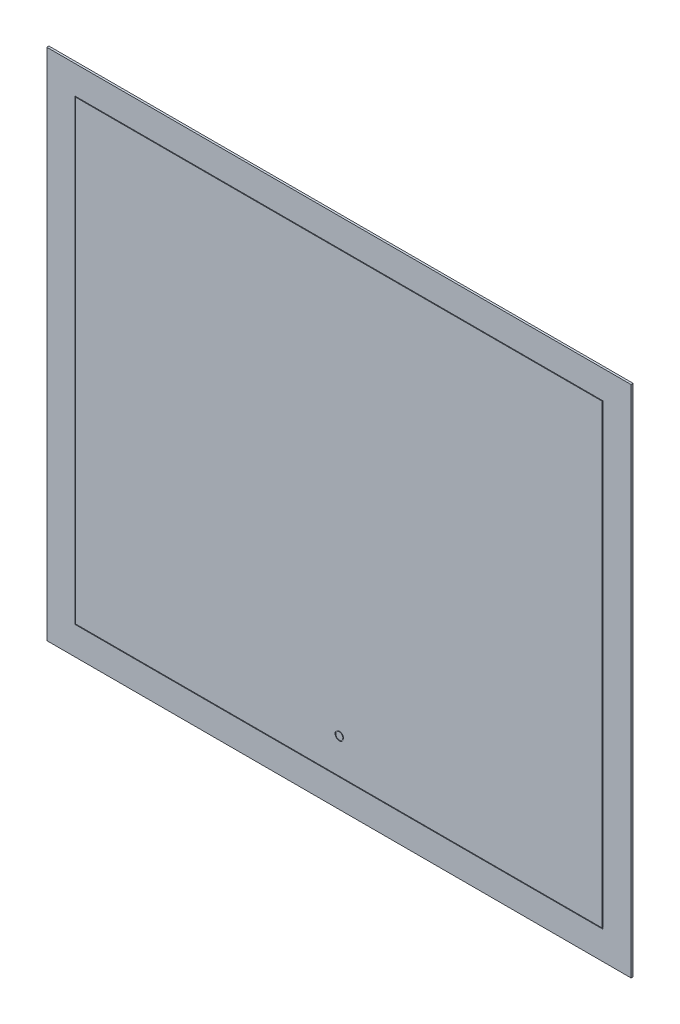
ISO-10303-21;
HEADER;
FILE_DESCRIPTION(('STEP AP214'),'2;1');
FILE_NAME('part.step','',(''),(''),'','','');
FILE_SCHEMA(('AUTOMOTIVE_DESIGN { 1 0 10303 214 1 1 1 1 }'));
ENDSEC;
DATA;
#1=APPLICATION_CONTEXT('core data for automotive mechanical design processes');
#2=APPLICATION_PROTOCOL_DEFINITION('international standard','automotive_design',2000,#1);
#3=PRODUCT_CONTEXT('',#1,'mechanical');
#4=PRODUCT('Part','Part','',(#3));
#5=PRODUCT_RELATED_PRODUCT_CATEGORY('part','',(#4));
#6=PRODUCT_DEFINITION_FORMATION('','',#4);
#7=PRODUCT_DEFINITION_CONTEXT('part definition',#1,'design');
#8=PRODUCT_DEFINITION('design','',#6,#7);
#9=PRODUCT_DEFINITION_SHAPE('','',#8);
#10=(LENGTH_UNIT() NAMED_UNIT(*) SI_UNIT(.MILLI.,.METRE.));
#11=(NAMED_UNIT(*) PLANE_ANGLE_UNIT() SI_UNIT($,.RADIAN.));
#12=(NAMED_UNIT(*) SI_UNIT($,.STERADIAN.) SOLID_ANGLE_UNIT());
#13=UNCERTAINTY_MEASURE_WITH_UNIT(LENGTH_MEASURE(1.E-05),#10,'distance_accuracy_value','');
#14=(GEOMETRIC_REPRESENTATION_CONTEXT(3) GLOBAL_UNCERTAINTY_ASSIGNED_CONTEXT((#13)) GLOBAL_UNIT_ASSIGNED_CONTEXT((#10,
#11,#12)) REPRESENTATION_CONTEXT('',''));
#15=CARTESIAN_POINT('',(0.,0.,0.));
#16=DIRECTION('',(0.,0.,1.));
#17=DIRECTION('',(1.,0.,0.));
#18=AXIS2_PLACEMENT_3D('',#15,#16,#17);
#19=CARTESIAN_POINT('',(0.,0.,0.));
#20=DIRECTION('',(0.,0.,1.));
#21=DIRECTION('',(1.,0.,0.));
#22=AXIS2_PLACEMENT_3D('',#19,#20,#21);
#23=PLANE('',#22);
#24=DIRECTION('',(-1.,0.,0.));
#25=VECTOR('',#24,1.);
#26=CARTESIAN_POINT('',(0.,0.,0.));
#27=LINE('',#26,#25);
#28=CARTESIAN_POINT('',(830.,0.,0.));
#29=VERTEX_POINT('',#28);
#30=CARTESIAN_POINT('',(0.,0.,0.));
#31=VERTEX_POINT('',#30);
#32=EDGE_CURVE('E356',#29,#31,#27,.T.);
#33=ORIENTED_EDGE('',*,*,#32,.T.);
#34=DIRECTION('',(0.,1.,0.));
#35=VECTOR('',#34,1.);
#36=CARTESIAN_POINT('',(0.,0.,0.));
#37=LINE('',#36,#35);
#38=CARTESIAN_POINT('',(0.,730.,0.));
#39=VERTEX_POINT('',#38);
#40=EDGE_CURVE('E371',#31,#39,#37,.T.);
#41=ORIENTED_EDGE('',*,*,#40,.T.);
#42=DIRECTION('',(1.,0.,0.));
#43=VECTOR('',#42,1.);
#44=CARTESIAN_POINT('',(0.,730.,0.));
#45=LINE('',#44,#43);
#46=CARTESIAN_POINT('',(830.,730.,0.));
#47=VERTEX_POINT('',#46);
#48=EDGE_CURVE('E391',#39,#47,#45,.T.);
#49=ORIENTED_EDGE('',*,*,#48,.T.);
#50=DIRECTION('',(0.,-1.,0.));
#51=VECTOR('',#50,1.);
#52=CARTESIAN_POINT('',(830.,1.26230837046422E-13,0.));
#53=LINE('',#52,#51);
#54=EDGE_CURVE('E387',#47,#29,#53,.T.);
#55=ORIENTED_EDGE('',*,*,#54,.T.);
#56=EDGE_LOOP('',(#33,#41,#49,#55));
#57=FACE_BOUND('',#56,.T.);
#58=DIRECTION('',(0.,-1.,0.));
#59=VECTOR('',#58,1.);
#60=CARTESIAN_POINT('',(795.,695.,0.));
#61=LINE('',#60,#59);
#62=CARTESIAN_POINT('',(795.,695.,0.));
#63=VERTEX_POINT('',#62);
#64=CARTESIAN_POINT('',(795.,35.,0.));
#65=VERTEX_POINT('',#64);
#66=EDGE_CURVE('E67',#63,#65,#61,.T.);
#67=ORIENTED_EDGE('',*,*,#66,.F.);
#68=DIRECTION('',(1.,0.,0.));
#69=VECTOR('',#68,1.);
#70=CARTESIAN_POINT('',(35.,695.,0.));
#71=LINE('',#70,#69);
#72=CARTESIAN_POINT('',(35.,695.,0.));
#73=VERTEX_POINT('',#72);
#74=EDGE_CURVE('E239',#73,#63,#71,.T.);
#75=ORIENTED_EDGE('',*,*,#74,.F.);
#76=DIRECTION('',(0.,1.,0.));
#77=VECTOR('',#76,1.);
#78=CARTESIAN_POINT('',(35.,35.,0.));
#79=LINE('',#78,#77);
#80=CARTESIAN_POINT('',(35.,35.,0.));
#81=VERTEX_POINT('',#80);
#82=EDGE_CURVE('E255',#81,#73,#79,.T.);
#83=ORIENTED_EDGE('',*,*,#82,.F.);
#84=DIRECTION('',(-1.,0.,0.));
#85=VECTOR('',#84,1.);
#86=CARTESIAN_POINT('',(795.,35.,0.));
#87=LINE('',#86,#85);
#88=EDGE_CURVE('E251',#65,#81,#87,.T.);
#89=ORIENTED_EDGE('',*,*,#88,.F.);
#90=EDGE_LOOP('',(#67,#75,#83,#89));
#91=FACE_BOUND('',#90,.T.);
#92=ADVANCED_FACE('F43',(#57,#91),#23,.F.);
#93=CARTESIAN_POINT('',(0.,0.,3.));
#94=DIRECTION('',(0.,-1.,0.));
#95=DIRECTION('',(1.,0.,0.));
#96=AXIS2_PLACEMENT_3D('',#93,#94,#95);
#97=PLANE('',#96);
#98=ORIENTED_EDGE('',*,*,#32,.F.);
#99=DIRECTION('',(0.,0.,-1.));
#100=VECTOR('',#99,1.);
#101=CARTESIAN_POINT('',(830.,0.,3.));
#102=LINE('',#101,#100);
#103=CARTESIAN_POINT('',(830.,0.,3.));
#104=VERTEX_POINT('',#103);
#105=EDGE_CURVE('E11',#104,#29,#102,.T.);
#106=ORIENTED_EDGE('',*,*,#105,.F.);
#107=DIRECTION('',(-1.,0.,0.));
#108=VECTOR('',#107,1.);
#109=CARTESIAN_POINT('',(0.,0.,3.));
#110=LINE('',#109,#108);
#111=CARTESIAN_POINT('',(0.,0.,3.));
#112=VERTEX_POINT('',#111);
#113=EDGE_CURVE('E366',#104,#112,#110,.T.);
#114=ORIENTED_EDGE('',*,*,#113,.T.);
#115=DIRECTION('',(0.,0.,-1.));
#116=VECTOR('',#115,1.);
#117=CARTESIAN_POINT('',(0.,0.,3.));
#118=LINE('',#117,#116);
#119=EDGE_CURVE('E383',#112,#31,#118,.T.);
#120=ORIENTED_EDGE('',*,*,#119,.T.);
#121=EDGE_LOOP('',(#98,#106,#114,#120));
#122=FACE_BOUND('',#121,.T.);
#123=ADVANCED_FACE('F45',(#122),#97,.T.);
#124=CARTESIAN_POINT('',(830.,1.26230837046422E-13,3.));
#125=DIRECTION('',(1.,0.,0.));
#126=DIRECTION('',(0.,1.,0.));
#127=AXIS2_PLACEMENT_3D('',#124,#125,#126);
#128=PLANE('',#127);
#129=ORIENTED_EDGE('',*,*,#54,.F.);
#130=DIRECTION('',(0.,0.,-1.));
#131=VECTOR('',#130,1.);
#132=CARTESIAN_POINT('',(830.,730.,3.));
#133=LINE('',#132,#131);
#134=CARTESIAN_POINT('',(830.,730.,3.));
#135=VERTEX_POINT('',#134);
#136=EDGE_CURVE('E52',#135,#47,#133,.T.);
#137=ORIENTED_EDGE('',*,*,#136,.F.);
#138=DIRECTION('',(0.,-1.,0.));
#139=VECTOR('',#138,1.);
#140=CARTESIAN_POINT('',(830.,1.26230837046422E-13,3.));
#141=LINE('',#140,#139);
#142=EDGE_CURVE('E370',#135,#104,#141,.T.);
#143=ORIENTED_EDGE('',*,*,#142,.T.);
#144=ORIENTED_EDGE('',*,*,#105,.T.);
#145=EDGE_LOOP('',(#129,#137,#143,#144));
#146=FACE_BOUND('',#145,.T.);
#147=ADVANCED_FACE('F410',(#146),#128,.T.);
#148=CARTESIAN_POINT('',(0.,730.,3.));
#149=DIRECTION('',(0.,1.,0.));
#150=DIRECTION('',(0.,0.,1.));
#151=AXIS2_PLACEMENT_3D('',#148,#149,#150);
#152=PLANE('',#151);
#153=ORIENTED_EDGE('',*,*,#48,.F.);
#154=DIRECTION('',(0.,0.,-1.));
#155=VECTOR('',#154,1.);
#156=CARTESIAN_POINT('',(0.,730.,3.));
#157=LINE('',#156,#155);
#158=CARTESIAN_POINT('',(0.,730.,3.));
#159=VERTEX_POINT('',#158);
#160=EDGE_CURVE('E400',#159,#39,#157,.T.);
#161=ORIENTED_EDGE('',*,*,#160,.F.);
#162=DIRECTION('',(1.,0.,0.));
#163=VECTOR('',#162,1.);
#164=CARTESIAN_POINT('',(0.,730.,3.));
#165=LINE('',#164,#163);
#166=EDGE_CURVE('E375',#159,#135,#165,.T.);
#167=ORIENTED_EDGE('',*,*,#166,.T.);
#168=ORIENTED_EDGE('',*,*,#136,.T.);
#169=EDGE_LOOP('',(#153,#161,#167,#168));
#170=FACE_BOUND('',#169,.T.);
#171=ADVANCED_FACE('F406',(#170),#152,.T.);
#172=CARTESIAN_POINT('',(0.,0.,3.));
#173=DIRECTION('',(-1.,0.,0.));
#174=DIRECTION('',(0.,0.,1.));
#175=AXIS2_PLACEMENT_3D('',#172,#173,#174);
#176=PLANE('',#175);
#177=ORIENTED_EDGE('',*,*,#40,.F.);
#178=ORIENTED_EDGE('',*,*,#119,.F.);
#179=DIRECTION('',(0.,1.,0.));
#180=VECTOR('',#179,1.);
#181=CARTESIAN_POINT('',(0.,0.,3.));
#182=LINE('',#181,#180);
#183=EDGE_CURVE('E379',#112,#159,#182,.T.);
#184=ORIENTED_EDGE('',*,*,#183,.T.);
#185=ORIENTED_EDGE('',*,*,#160,.T.);
#186=EDGE_LOOP('',(#177,#178,#184,#185));
#187=FACE_BOUND('',#186,.T.);
#188=ADVANCED_FACE('F415',(#187),#176,.T.);
#189=CARTESIAN_POINT('',(0.,0.,3.));
#190=DIRECTION('',(0.,0.,1.));
#191=DIRECTION('',(1.,0.,0.));
#192=AXIS2_PLACEMENT_3D('',#189,#190,#191);
#193=PLANE('',#192);
#194=DIRECTION('',(0.,-1.,0.));
#195=VECTOR('',#194,1.);
#196=CARTESIAN_POINT('',(40.,690.,3.));
#197=LINE('',#196,#195);
#198=CARTESIAN_POINT('',(40.,690.,3.));
#199=VERTEX_POINT('',#198);
#200=CARTESIAN_POINT('',(40.,40.,3.));
#201=VERTEX_POINT('',#200);
#202=EDGE_CURVE('E312',#199,#201,#197,.T.);
#203=ORIENTED_EDGE('',*,*,#202,.F.);
#204=DIRECTION('',(-1.,0.,0.));
#205=VECTOR('',#204,1.);
#206=CARTESIAN_POINT('',(790.,690.,3.));
#207=LINE('',#206,#205);
#208=CARTESIAN_POINT('',(790.,690.,3.));
#209=VERTEX_POINT('',#208);
#210=EDGE_CURVE('E327',#209,#199,#207,.T.);
#211=ORIENTED_EDGE('',*,*,#210,.F.);
#212=DIRECTION('',(0.,1.,0.));
#213=VECTOR('',#212,1.);
#214=CARTESIAN_POINT('',(790.,40.,3.));
#215=LINE('',#214,#213);
#216=CARTESIAN_POINT('',(790.,40.,3.));
#217=VERTEX_POINT('',#216);
#218=EDGE_CURVE('E346',#217,#209,#215,.T.);
#219=ORIENTED_EDGE('',*,*,#218,.F.);
#220=DIRECTION('',(1.,0.,0.));
#221=VECTOR('',#220,1.);
#222=CARTESIAN_POINT('',(40.,40.,3.));
#223=LINE('',#222,#221);
#224=EDGE_CURVE('E342',#201,#217,#223,.T.);
#225=ORIENTED_EDGE('',*,*,#224,.F.);
#226=EDGE_LOOP('',(#203,#211,#219,#225));
#227=FACE_BOUND('',#226,.T.);
#228=ORIENTED_EDGE('',*,*,#113,.F.);
#229=ORIENTED_EDGE('',*,*,#142,.F.);
#230=ORIENTED_EDGE('',*,*,#166,.F.);
#231=ORIENTED_EDGE('',*,*,#183,.F.);
#232=EDGE_LOOP('',(#228,#229,#230,#231));
#233=FACE_BOUND('',#232,.T.);
#234=ADVANCED_FACE('F419',(#227,#233),#193,.T.);
#235=CARTESIAN_POINT('',(40.,690.,2.));
#236=DIRECTION('',(-1.,0.,0.));
#237=DIRECTION('',(0.,0.,1.));
#238=AXIS2_PLACEMENT_3D('',#235,#236,#237);
#239=PLANE('',#238);
#240=ORIENTED_EDGE('',*,*,#202,.T.);
#241=DIRECTION('',(0.,0.,1.));
#242=VECTOR('',#241,1.);
#243=CARTESIAN_POINT('',(40.,40.,2.));
#244=LINE('',#243,#242);
#245=CARTESIAN_POINT('',(40.,40.,2.));
#246=VERTEX_POINT('',#245);
#247=EDGE_CURVE('E339',#246,#201,#244,.T.);
#248=ORIENTED_EDGE('',*,*,#247,.F.);
#249=DIRECTION('',(0.,-1.,0.));
#250=VECTOR('',#249,1.);
#251=CARTESIAN_POINT('',(40.,690.,2.));
#252=LINE('',#251,#250);
#253=CARTESIAN_POINT('',(40.,690.,2.));
#254=VERTEX_POINT('',#253);
#255=EDGE_CURVE('E322',#254,#246,#252,.T.);
#256=ORIENTED_EDGE('',*,*,#255,.F.);
#257=DIRECTION('',(0.,0.,1.));
#258=VECTOR('',#257,1.);
#259=CARTESIAN_POINT('',(40.,690.,2.));
#260=LINE('',#259,#258);
#261=EDGE_CURVE('E353',#254,#199,#260,.T.);
#262=ORIENTED_EDGE('',*,*,#261,.T.);
#263=EDGE_LOOP('',(#240,#248,#256,#262));
#264=FACE_BOUND('',#263,.T.);
#265=ADVANCED_FACE('F450',(#264),#239,.F.);
#266=CARTESIAN_POINT('',(790.,690.,2.));
#267=DIRECTION('',(0.,1.,0.));
#268=DIRECTION('',(0.,0.,1.));
#269=AXIS2_PLACEMENT_3D('',#266,#267,#268);
#270=PLANE('',#269);
#271=ORIENTED_EDGE('',*,*,#210,.T.);
#272=ORIENTED_EDGE('',*,*,#261,.F.);
#273=DIRECTION('',(-1.,0.,0.));
#274=VECTOR('',#273,1.);
#275=CARTESIAN_POINT('',(790.,690.,2.));
#276=LINE('',#275,#274);
#277=CARTESIAN_POINT('',(790.,690.,2.));
#278=VERTEX_POINT('',#277);
#279=EDGE_CURVE('E335',#278,#254,#276,.T.);
#280=ORIENTED_EDGE('',*,*,#279,.F.);
#281=DIRECTION('',(0.,0.,1.));
#282=VECTOR('',#281,1.);
#283=CARTESIAN_POINT('',(790.,690.,2.));
#284=LINE('',#283,#282);
#285=EDGE_CURVE('E357',#278,#209,#284,.T.);
#286=ORIENTED_EDGE('',*,*,#285,.T.);
#287=EDGE_LOOP('',(#271,#272,#280,#286));
#288=FACE_BOUND('',#287,.T.);
#289=ADVANCED_FACE('F459',(#288),#270,.F.);
#290=CARTESIAN_POINT('',(790.,40.,2.));
#291=DIRECTION('',(1.,0.,0.));
#292=DIRECTION('',(0.,1.,0.));
#293=AXIS2_PLACEMENT_3D('',#290,#291,#292);
#294=PLANE('',#293);
#295=ORIENTED_EDGE('',*,*,#218,.T.);
#296=ORIENTED_EDGE('',*,*,#285,.F.);
#297=DIRECTION('',(0.,1.,0.));
#298=VECTOR('',#297,1.);
#299=CARTESIAN_POINT('',(790.,40.,2.));
#300=LINE('',#299,#298);
#301=CARTESIAN_POINT('',(790.,40.,2.));
#302=VERTEX_POINT('',#301);
#303=EDGE_CURVE('E331',#302,#278,#300,.T.);
#304=ORIENTED_EDGE('',*,*,#303,.F.);
#305=DIRECTION('',(0.,0.,1.));
#306=VECTOR('',#305,1.);
#307=CARTESIAN_POINT('',(790.,40.,2.));
#308=LINE('',#307,#306);
#309=EDGE_CURVE('E360',#302,#217,#308,.T.);
#310=ORIENTED_EDGE('',*,*,#309,.T.);
#311=EDGE_LOOP('',(#295,#296,#304,#310));
#312=FACE_BOUND('',#311,.T.);
#313=ADVANCED_FACE('F466',(#312),#294,.F.);
#314=CARTESIAN_POINT('',(40.,40.,2.));
#315=DIRECTION('',(0.,-1.,0.));
#316=DIRECTION('',(1.,0.,0.));
#317=AXIS2_PLACEMENT_3D('',#314,#315,#316);
#318=PLANE('',#317);
#319=ORIENTED_EDGE('',*,*,#224,.T.);
#320=ORIENTED_EDGE('',*,*,#309,.F.);
#321=DIRECTION('',(1.,0.,0.));
#322=VECTOR('',#321,1.);
#323=CARTESIAN_POINT('',(40.,40.,2.));
#324=LINE('',#323,#322);
#325=EDGE_CURVE('E326',#246,#302,#324,.T.);
#326=ORIENTED_EDGE('',*,*,#325,.F.);
#327=ORIENTED_EDGE('',*,*,#247,.T.);
#328=EDGE_LOOP('',(#319,#320,#326,#327));
#329=FACE_BOUND('',#328,.T.);
#330=ADVANCED_FACE('F474',(#329),#318,.F.);
#331=CARTESIAN_POINT('',(0.,0.,2.));
#332=DIRECTION('',(0.,0.,1.));
#333=DIRECTION('',(1.,0.,0.));
#334=AXIS2_PLACEMENT_3D('',#331,#332,#333);
#335=PLANE('',#334);
#336=DIRECTION('',(0.,1.,0.));
#337=VECTOR('',#336,1.);
#338=CARTESIAN_POINT('',(789.,41.,2.));
#339=LINE('',#338,#337);
#340=CARTESIAN_POINT('',(789.,41.,2.));
#341=VERTEX_POINT('',#340);
#342=CARTESIAN_POINT('',(789.,689.,2.));
#343=VERTEX_POINT('',#342);
#344=EDGE_CURVE('E290',#341,#343,#339,.T.);
#345=ORIENTED_EDGE('',*,*,#344,.F.);
#346=DIRECTION('',(1.,0.,0.));
#347=VECTOR('',#346,1.);
#348=CARTESIAN_POINT('',(41.,41.,2.));
#349=LINE('',#348,#347);
#350=CARTESIAN_POINT('',(41.,41.,2.));
#351=VERTEX_POINT('',#350);
#352=EDGE_CURVE('E286',#351,#341,#349,.T.);
#353=ORIENTED_EDGE('',*,*,#352,.F.);
#354=DIRECTION('',(0.,-1.,0.));
#355=VECTOR('',#354,1.);
#356=CARTESIAN_POINT('',(41.,689.,2.));
#357=LINE('',#356,#355);
#358=CARTESIAN_POINT('',(41.,689.,2.));
#359=VERTEX_POINT('',#358);
#360=EDGE_CURVE('E281',#359,#351,#357,.T.);
#361=ORIENTED_EDGE('',*,*,#360,.F.);
#362=DIRECTION('',(-1.,0.,0.));
#363=VECTOR('',#362,1.);
#364=CARTESIAN_POINT('',(789.,689.,2.));
#365=LINE('',#364,#363);
#366=EDGE_CURVE('E277',#343,#359,#365,.T.);
#367=ORIENTED_EDGE('',*,*,#366,.F.);
#368=EDGE_LOOP('',(#345,#353,#361,#367));
#369=FACE_BOUND('',#368,.T.);
#370=ORIENTED_EDGE('',*,*,#255,.T.);
#371=ORIENTED_EDGE('',*,*,#325,.T.);
#372=ORIENTED_EDGE('',*,*,#303,.T.);
#373=ORIENTED_EDGE('',*,*,#279,.T.);
#374=EDGE_LOOP('',(#370,#371,#372,#373));
#375=FACE_BOUND('',#374,.T.);
#376=ADVANCED_FACE('F482',(#369,#375),#335,.T.);
#377=CARTESIAN_POINT('',(789.,689.,2.));
#378=DIRECTION('',(0.,1.,0.));
#379=DIRECTION('',(0.,0.,1.));
#380=AXIS2_PLACEMENT_3D('',#377,#378,#379);
#381=PLANE('',#380);
#382=DIRECTION('',(-1.,0.,0.));
#383=VECTOR('',#382,1.);
#384=CARTESIAN_POINT('',(789.,689.,3.));
#385=LINE('',#384,#383);
#386=CARTESIAN_POINT('',(789.,689.,3.));
#387=VERTEX_POINT('',#386);
#388=CARTESIAN_POINT('',(41.,689.,3.));
#389=VERTEX_POINT('',#388);
#390=EDGE_CURVE('E276',#387,#389,#385,.T.);
#391=ORIENTED_EDGE('',*,*,#390,.F.);
#392=DIRECTION('',(0.,0.,1.));
#393=VECTOR('',#392,1.);
#394=CARTESIAN_POINT('',(789.,689.,2.));
#395=LINE('',#394,#393);
#396=EDGE_CURVE('E309',#343,#387,#395,.T.);
#397=ORIENTED_EDGE('',*,*,#396,.F.);
#398=ORIENTED_EDGE('',*,*,#366,.T.);
#399=DIRECTION('',(0.,0.,1.));
#400=VECTOR('',#399,1.);
#401=CARTESIAN_POINT('',(41.,689.,2.));
#402=LINE('',#401,#400);
#403=EDGE_CURVE('E294',#359,#389,#402,.T.);
#404=ORIENTED_EDGE('',*,*,#403,.T.);
#405=EDGE_LOOP('',(#391,#397,#398,#404));
#406=FACE_BOUND('',#405,.T.);
#407=ADVANCED_FACE('F490',(#406),#381,.T.);
#408=CARTESIAN_POINT('',(789.,41.,2.));
#409=DIRECTION('',(1.,0.,0.));
#410=DIRECTION('',(0.,0.,-1.));
#411=AXIS2_PLACEMENT_3D('',#408,#409,#410);
#412=PLANE('',#411);
#413=DIRECTION('',(0.,1.,0.));
#414=VECTOR('',#413,1.);
#415=CARTESIAN_POINT('',(789.,41.,3.));
#416=LINE('',#415,#414);
#417=CARTESIAN_POINT('',(789.,41.,3.));
#418=VERTEX_POINT('',#417);
#419=EDGE_CURVE('E282',#418,#387,#416,.T.);
#420=ORIENTED_EDGE('',*,*,#419,.F.);
#421=DIRECTION('',(0.,0.,1.));
#422=VECTOR('',#421,1.);
#423=CARTESIAN_POINT('',(789.,41.,2.));
#424=LINE('',#423,#422);
#425=EDGE_CURVE('E313',#341,#418,#424,.T.);
#426=ORIENTED_EDGE('',*,*,#425,.F.);
#427=ORIENTED_EDGE('',*,*,#344,.T.);
#428=ORIENTED_EDGE('',*,*,#396,.T.);
#429=EDGE_LOOP('',(#420,#426,#427,#428));
#430=FACE_BOUND('',#429,.T.);
#431=ADVANCED_FACE('F498',(#430),#412,.T.);
#432=CARTESIAN_POINT('',(41.,41.,2.));
#433=DIRECTION('',(0.,-1.,0.));
#434=DIRECTION('',(1.,0.,0.));
#435=AXIS2_PLACEMENT_3D('',#432,#433,#434);
#436=PLANE('',#435);
#437=DIRECTION('',(1.,0.,0.));
#438=VECTOR('',#437,1.);
#439=CARTESIAN_POINT('',(41.,41.,3.));
#440=LINE('',#439,#438);
#441=CARTESIAN_POINT('',(41.,41.,3.));
#442=VERTEX_POINT('',#441);
#443=EDGE_CURVE('E302',#442,#418,#440,.T.);
#444=ORIENTED_EDGE('',*,*,#443,.F.);
#445=DIRECTION('',(0.,0.,1.));
#446=VECTOR('',#445,1.);
#447=CARTESIAN_POINT('',(41.,41.,2.));
#448=LINE('',#447,#446);
#449=EDGE_CURVE('E316',#351,#442,#448,.T.);
#450=ORIENTED_EDGE('',*,*,#449,.F.);
#451=ORIENTED_EDGE('',*,*,#352,.T.);
#452=ORIENTED_EDGE('',*,*,#425,.T.);
#453=EDGE_LOOP('',(#444,#450,#451,#452));
#454=FACE_BOUND('',#453,.T.);
#455=ADVANCED_FACE('F506',(#454),#436,.T.);
#456=CARTESIAN_POINT('',(41.,689.,2.));
#457=DIRECTION('',(-1.,0.,0.));
#458=DIRECTION('',(0.,0.,1.));
#459=AXIS2_PLACEMENT_3D('',#456,#457,#458);
#460=PLANE('',#459);
#461=DIRECTION('',(0.,-1.,0.));
#462=VECTOR('',#461,1.);
#463=CARTESIAN_POINT('',(41.,689.,3.));
#464=LINE('',#463,#462);
#465=EDGE_CURVE('E298',#389,#442,#464,.T.);
#466=ORIENTED_EDGE('',*,*,#465,.F.);
#467=ORIENTED_EDGE('',*,*,#403,.F.);
#468=ORIENTED_EDGE('',*,*,#360,.T.);
#469=ORIENTED_EDGE('',*,*,#449,.T.);
#470=EDGE_LOOP('',(#466,#467,#468,#469));
#471=FACE_BOUND('',#470,.T.);
#472=ADVANCED_FACE('F514',(#471),#460,.T.);
#473=CARTESIAN_POINT('',(415.5,90.4999999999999,3.));
#474=DIRECTION('',(0.,0.,1.));
#475=DIRECTION('',(1.,0.,0.));
#476=AXIS2_PLACEMENT_3D('',#473,#474,#475);
#477=CIRCLE('',#476,5.99999999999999);
#478=CARTESIAN_POINT('',(421.5,90.4999999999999,3.));
#479=VERTEX_POINT('',#478);
#480=EDGE_CURVE('E210',#479,#479,#477,.T.);
#481=ORIENTED_EDGE('',*,*,#480,.F.);
#482=EDGE_LOOP('',(#481));
#483=FACE_BOUND('',#482,.T.);
#484=ORIENTED_EDGE('',*,*,#419,.T.);
#485=ORIENTED_EDGE('',*,*,#390,.T.);
#486=ORIENTED_EDGE('',*,*,#465,.T.);
#487=ORIENTED_EDGE('',*,*,#443,.T.);
#488=EDGE_LOOP('',(#484,#485,#486,#487));
#489=FACE_BOUND('',#488,.T.);
#490=ADVANCED_FACE('F453',(#483,#489),#193,.T.);
#491=CARTESIAN_POINT('',(795.,695.,-30.));
#492=DIRECTION('',(-1.,0.,0.));
#493=DIRECTION('',(0.,-1.,0.));
#494=AXIS2_PLACEMENT_3D('',#491,#492,#493);
#495=PLANE('',#494);
#496=ORIENTED_EDGE('',*,*,#66,.T.);
#497=DIRECTION('',(0.,0.,1.));
#498=VECTOR('',#497,1.);
#499=CARTESIAN_POINT('',(795.,35.,-30.));
#500=LINE('',#499,#498);
#501=CARTESIAN_POINT('',(795.,35.,-30.));
#502=VERTEX_POINT('',#501);
#503=EDGE_CURVE('E272',#502,#65,#500,.T.);
#504=ORIENTED_EDGE('',*,*,#503,.F.);
#505=DIRECTION('',(0.,-1.,0.));
#506=VECTOR('',#505,1.);
#507=CARTESIAN_POINT('',(795.,695.,-30.));
#508=LINE('',#507,#506);
#509=CARTESIAN_POINT('',(795.,695.,-30.));
#510=VERTEX_POINT('',#509);
#511=EDGE_CURVE('E234',#510,#502,#508,.T.);
#512=ORIENTED_EDGE('',*,*,#511,.F.);
#513=DIRECTION('',(0.,0.,1.));
#514=VECTOR('',#513,1.);
#515=CARTESIAN_POINT('',(795.,695.,-30.));
#516=LINE('',#515,#514);
#517=EDGE_CURVE('E248',#510,#63,#516,.T.);
#518=ORIENTED_EDGE('',*,*,#517,.T.);
#519=EDGE_LOOP('',(#496,#504,#512,#518));
#520=FACE_BOUND('',#519,.T.);
#521=ADVANCED_FACE('F529',(#520),#495,.F.);
#522=CARTESIAN_POINT('',(795.,35.,-30.));
#523=DIRECTION('',(0.,1.,0.));
#524=DIRECTION('',(-1.,0.,0.));
#525=AXIS2_PLACEMENT_3D('',#522,#523,#524);
#526=PLANE('',#525);
#527=ORIENTED_EDGE('',*,*,#88,.T.);
#528=DIRECTION('',(0.,0.,1.));
#529=VECTOR('',#528,1.);
#530=CARTESIAN_POINT('',(35.,35.,-30.));
#531=LINE('',#530,#529);
#532=CARTESIAN_POINT('',(35.,35.,-30.));
#533=VERTEX_POINT('',#532);
#534=EDGE_CURVE('E268',#533,#81,#531,.T.);
#535=ORIENTED_EDGE('',*,*,#534,.F.);
#536=DIRECTION('',(-1.,0.,0.));
#537=VECTOR('',#536,1.);
#538=CARTESIAN_POINT('',(795.,35.,-30.));
#539=LINE('',#538,#537);
#540=EDGE_CURVE('E238',#502,#533,#539,.T.);
#541=ORIENTED_EDGE('',*,*,#540,.F.);
#542=ORIENTED_EDGE('',*,*,#503,.T.);
#543=EDGE_LOOP('',(#527,#535,#541,#542));
#544=FACE_BOUND('',#543,.T.);
#545=ADVANCED_FACE('F536',(#544),#526,.F.);
#546=CARTESIAN_POINT('',(35.,35.,-30.));
#547=DIRECTION('',(1.,0.,0.));
#548=DIRECTION('',(0.,0.,-1.));
#549=AXIS2_PLACEMENT_3D('',#546,#547,#548);
#550=PLANE('',#549);
#551=ORIENTED_EDGE('',*,*,#82,.T.);
#552=DIRECTION('',(0.,0.,1.));
#553=VECTOR('',#552,1.);
#554=CARTESIAN_POINT('',(35.,695.,-30.));
#555=LINE('',#554,#553);
#556=CARTESIAN_POINT('',(35.,695.,-30.));
#557=VERTEX_POINT('',#556);
#558=EDGE_CURVE('E264',#557,#73,#555,.T.);
#559=ORIENTED_EDGE('',*,*,#558,.F.);
#560=DIRECTION('',(0.,1.,0.));
#561=VECTOR('',#560,1.);
#562=CARTESIAN_POINT('',(35.,35.,-30.));
#563=LINE('',#562,#561);
#564=EDGE_CURVE('E242',#533,#557,#563,.T.);
#565=ORIENTED_EDGE('',*,*,#564,.F.);
#566=ORIENTED_EDGE('',*,*,#534,.T.);
#567=EDGE_LOOP('',(#551,#559,#565,#566));
#568=FACE_BOUND('',#567,.T.);
#569=ADVANCED_FACE('F544',(#568),#550,.F.);
#570=CARTESIAN_POINT('',(35.,695.,-30.));
#571=DIRECTION('',(0.,-1.,0.));
#572=DIRECTION('',(0.,0.,-1.));
#573=AXIS2_PLACEMENT_3D('',#570,#571,#572);
#574=PLANE('',#573);
#575=ORIENTED_EDGE('',*,*,#74,.T.);
#576=ORIENTED_EDGE('',*,*,#517,.F.);
#577=DIRECTION('',(1.,0.,0.));
#578=VECTOR('',#577,1.);
#579=CARTESIAN_POINT('',(35.,695.,-30.));
#580=LINE('',#579,#578);
#581=EDGE_CURVE('E245',#557,#510,#580,.T.);
#582=ORIENTED_EDGE('',*,*,#581,.F.);
#583=ORIENTED_EDGE('',*,*,#558,.T.);
#584=EDGE_LOOP('',(#575,#576,#582,#583));
#585=FACE_BOUND('',#584,.T.);
#586=ADVANCED_FACE('F552',(#585),#574,.F.);
#587=CARTESIAN_POINT('',(0.,0.,-30.));
#588=DIRECTION('',(0.,0.,-1.));
#589=DIRECTION('',(-1.,0.,0.));
#590=AXIS2_PLACEMENT_3D('',#587,#588,#589);
#591=PLANE('',#590);
#592=DIRECTION('',(1.,0.,0.));
#593=VECTOR('',#592,1.);
#594=CARTESIAN_POINT('',(36.,694.,-30.));
#595=LINE('',#594,#593);
#596=CARTESIAN_POINT('',(36.,694.,-30.));
#597=VERTEX_POINT('',#596);
#598=CARTESIAN_POINT('',(794.,694.,-30.));
#599=VERTEX_POINT('',#598);
#600=EDGE_CURVE('E59',#597,#599,#595,.T.);
#601=ORIENTED_EDGE('',*,*,#600,.F.);
#602=DIRECTION('',(0.,1.,0.));
#603=VECTOR('',#602,1.);
#604=CARTESIAN_POINT('',(36.,36.,-30.));
#605=LINE('',#604,#603);
#606=CARTESIAN_POINT('',(36.,36.,-30.));
#607=VERTEX_POINT('',#606);
#608=EDGE_CURVE('E203',#607,#597,#605,.T.);
#609=ORIENTED_EDGE('',*,*,#608,.F.);
#610=DIRECTION('',(-1.,0.,0.));
#611=VECTOR('',#610,1.);
#612=CARTESIAN_POINT('',(794.,36.,-30.));
#613=LINE('',#612,#611);
#614=CARTESIAN_POINT('',(794.,36.,-30.));
#615=VERTEX_POINT('',#614);
#616=EDGE_CURVE('E207',#615,#607,#613,.T.);
#617=ORIENTED_EDGE('',*,*,#616,.F.);
#618=DIRECTION('',(0.,-1.,0.));
#619=VECTOR('',#618,1.);
#620=CARTESIAN_POINT('',(794.,694.,-30.));
#621=LINE('',#620,#619);
#622=EDGE_CURVE('E219',#599,#615,#621,.T.);
#623=ORIENTED_EDGE('',*,*,#622,.F.);
#624=EDGE_LOOP('',(#601,#609,#617,#623));
#625=FACE_BOUND('',#624,.T.);
#626=ORIENTED_EDGE('',*,*,#511,.T.);
#627=ORIENTED_EDGE('',*,*,#540,.T.);
#628=ORIENTED_EDGE('',*,*,#564,.T.);
#629=ORIENTED_EDGE('',*,*,#581,.T.);
#630=EDGE_LOOP('',(#626,#627,#628,#629));
#631=FACE_BOUND('',#630,.T.);
#632=ADVANCED_FACE('F560',(#625,#631),#591,.T.);
#633=CARTESIAN_POINT('',(36.,694.,0.));
#634=DIRECTION('',(0.,1.,0.));
#635=DIRECTION('',(0.,0.,1.));
#636=AXIS2_PLACEMENT_3D('',#633,#634,#635);
#637=PLANE('',#636);
#638=ORIENTED_EDGE('',*,*,#600,.T.);
#639=DIRECTION('',(0.,0.,-1.));
#640=VECTOR('',#639,1.);
#641=CARTESIAN_POINT('',(794.,694.,0.));
#642=LINE('',#641,#640);
#643=CARTESIAN_POINT('',(794.,694.,0.));
#644=VERTEX_POINT('',#643);
#645=EDGE_CURVE('E178',#644,#599,#642,.T.);
#646=ORIENTED_EDGE('',*,*,#645,.F.);
#647=DIRECTION('',(1.,0.,0.));
#648=VECTOR('',#647,1.);
#649=CARTESIAN_POINT('',(36.,694.,0.));
#650=LINE('',#649,#648);
#651=CARTESIAN_POINT('',(36.,694.,0.));
#652=VERTEX_POINT('',#651);
#653=EDGE_CURVE('E182',#652,#644,#650,.T.);
#654=ORIENTED_EDGE('',*,*,#653,.F.);
#655=DIRECTION('',(0.,0.,-1.));
#656=VECTOR('',#655,1.);
#657=CARTESIAN_POINT('',(36.,694.,0.));
#658=LINE('',#657,#656);
#659=EDGE_CURVE('E226',#652,#597,#658,.T.);
#660=ORIENTED_EDGE('',*,*,#659,.T.);
#661=EDGE_LOOP('',(#638,#646,#654,#660));
#662=FACE_BOUND('',#661,.T.);
#663=ADVANCED_FACE('F180',(#662),#637,.F.);
#664=CARTESIAN_POINT('',(36.,36.,0.));
#665=DIRECTION('',(-1.,0.,0.));
#666=DIRECTION('',(0.,0.,1.));
#667=AXIS2_PLACEMENT_3D('',#664,#665,#666);
#668=PLANE('',#667);
#669=ORIENTED_EDGE('',*,*,#608,.T.);
#670=ORIENTED_EDGE('',*,*,#659,.F.);
#671=DIRECTION('',(0.,1.,0.));
#672=VECTOR('',#671,1.);
#673=CARTESIAN_POINT('',(36.,36.,0.));
#674=LINE('',#673,#672);
#675=CARTESIAN_POINT('',(36.,36.,0.));
#676=VERTEX_POINT('',#675);
#677=EDGE_CURVE('E189',#676,#652,#674,.T.);
#678=ORIENTED_EDGE('',*,*,#677,.F.);
#679=DIRECTION('',(0.,0.,-1.));
#680=VECTOR('',#679,1.);
#681=CARTESIAN_POINT('',(36.,36.,0.));
#682=LINE('',#681,#680);
#683=EDGE_CURVE('E229',#676,#607,#682,.T.);
#684=ORIENTED_EDGE('',*,*,#683,.T.);
#685=EDGE_LOOP('',(#669,#670,#678,#684));
#686=FACE_BOUND('',#685,.T.);
#687=ADVANCED_FACE('F575',(#686),#668,.F.);
#688=CARTESIAN_POINT('',(794.,36.,0.));
#689=DIRECTION('',(0.,-1.,0.));
#690=DIRECTION('',(1.,0.,0.));
#691=AXIS2_PLACEMENT_3D('',#688,#689,#690);
#692=PLANE('',#691);
#693=ORIENTED_EDGE('',*,*,#616,.T.);
#694=ORIENTED_EDGE('',*,*,#683,.F.);
#695=DIRECTION('',(-1.,0.,0.));
#696=VECTOR('',#695,1.);
#697=CARTESIAN_POINT('',(794.,36.,0.));
#698=LINE('',#697,#696);
#699=CARTESIAN_POINT('',(794.,36.,0.));
#700=VERTEX_POINT('',#699);
#701=EDGE_CURVE('E198',#700,#676,#698,.T.);
#702=ORIENTED_EDGE('',*,*,#701,.F.);
#703=DIRECTION('',(0.,0.,-1.));
#704=VECTOR('',#703,1.);
#705=CARTESIAN_POINT('',(794.,36.,0.));
#706=LINE('',#705,#704);
#707=EDGE_CURVE('E188',#700,#615,#706,.T.);
#708=ORIENTED_EDGE('',*,*,#707,.T.);
#709=EDGE_LOOP('',(#693,#694,#702,#708));
#710=FACE_BOUND('',#709,.T.);
#711=ADVANCED_FACE('F582',(#710),#692,.F.);
#712=CARTESIAN_POINT('',(794.,694.,0.));
#713=DIRECTION('',(1.,0.,0.));
#714=DIRECTION('',(0.,1.,0.));
#715=AXIS2_PLACEMENT_3D('',#712,#713,#714);
#716=PLANE('',#715);
#717=ORIENTED_EDGE('',*,*,#622,.T.);
#718=ORIENTED_EDGE('',*,*,#707,.F.);
#719=DIRECTION('',(0.,-1.,0.));
#720=VECTOR('',#719,1.);
#721=CARTESIAN_POINT('',(794.,694.,0.));
#722=LINE('',#721,#720);
#723=EDGE_CURVE('E192',#644,#700,#722,.T.);
#724=ORIENTED_EDGE('',*,*,#723,.F.);
#725=ORIENTED_EDGE('',*,*,#645,.T.);
#726=EDGE_LOOP('',(#717,#718,#724,#725));
#727=FACE_BOUND('',#726,.T.);
#728=ADVANCED_FACE('F193',(#727),#716,.F.);
#729=CARTESIAN_POINT('',(0.,0.,0.));
#730=DIRECTION('',(0.,0.,-1.));
#731=DIRECTION('',(-1.,0.,0.));
#732=AXIS2_PLACEMENT_3D('',#729,#730,#731);
#733=PLANE('',#732);
#734=ORIENTED_EDGE('',*,*,#653,.T.);
#735=ORIENTED_EDGE('',*,*,#723,.T.);
#736=ORIENTED_EDGE('',*,*,#701,.T.);
#737=ORIENTED_EDGE('',*,*,#677,.T.);
#738=EDGE_LOOP('',(#734,#735,#736,#737));
#739=FACE_BOUND('',#738,.T.);
#740=ADVANCED_FACE('F200',(#739),#733,.T.);
#741=CARTESIAN_POINT('',(415.5,90.4999999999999,2.));
#742=DIRECTION('',(0.,0.,1.));
#743=DIRECTION('',(1.,0.,0.));
#744=AXIS2_PLACEMENT_3D('',#741,#742,#743);
#745=CYLINDRICAL_SURFACE('',#744,5.99999999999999);
#746=CARTESIAN_POINT('',(415.5,90.4999999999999,2.));
#747=DIRECTION('',(0.,0.,1.));
#748=DIRECTION('',(1.,0.,0.));
#749=AXIS2_PLACEMENT_3D('',#746,#747,#748);
#750=CIRCLE('',#749,5.99999999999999);
#751=CARTESIAN_POINT('',(421.5,90.4999999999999,2.));
#752=VERTEX_POINT('',#751);
#753=EDGE_CURVE('E220',#752,#752,#750,.T.);
#754=ORIENTED_EDGE('',*,*,#753,.F.);
#755=EDGE_LOOP('',(#754));
#756=FACE_BOUND('',#755,.T.);
#757=ORIENTED_EDGE('',*,*,#480,.T.);
#758=EDGE_LOOP('',(#757));
#759=FACE_BOUND('',#758,.T.);
#760=ADVANCED_FACE('F603',(#756,#759),#745,.F.);
#761=CARTESIAN_POINT('',(415.5,90.4999999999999,2.));
#762=DIRECTION('',(0.,0.,1.));
#763=DIRECTION('',(1.,0.,0.));
#764=AXIS2_PLACEMENT_3D('',#761,#762,#763);
#765=PLANE('',#764);
#766=CARTESIAN_POINT('',(415.5,90.4999999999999,2.));
#767=DIRECTION('',(0.,0.,1.));
#768=DIRECTION('',(1.,0.,0.));
#769=AXIS2_PLACEMENT_3D('',#766,#767,#768);
#770=CIRCLE('',#769,4.99999999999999);
#771=CARTESIAN_POINT('',(420.5,90.4999999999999,2.));
#772=VERTEX_POINT('',#771);
#773=EDGE_CURVE('E711',#772,#772,#770,.T.);
#774=ORIENTED_EDGE('',*,*,#773,.F.);
#775=EDGE_LOOP('',(#774));
#776=FACE_BOUND('',#775,.T.);
#777=ORIENTED_EDGE('',*,*,#753,.T.);
#778=EDGE_LOOP('',(#777));
#779=FACE_BOUND('',#778,.T.);
#780=ADVANCED_FACE('F610',(#776,#779),#765,.T.);
#781=CARTESIAN_POINT('',(415.5,90.4999999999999,2.));
#782=DIRECTION('',(0.,0.,1.));
#783=DIRECTION('',(1.,0.,0.));
#784=AXIS2_PLACEMENT_3D('',#781,#782,#783);
#785=CYLINDRICAL_SURFACE('',#784,4.99999999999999);
#786=ORIENTED_EDGE('',*,*,#773,.T.);
#787=EDGE_LOOP('',(#786));
#788=FACE_BOUND('',#787,.T.);
#789=CARTESIAN_POINT('',(415.5,90.4999999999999,3.));
#790=DIRECTION('',(0.,0.,1.));
#791=DIRECTION('',(1.,0.,0.));
#792=AXIS2_PLACEMENT_3D('',#789,#790,#791);
#793=CIRCLE('',#792,4.99999999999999);
#794=CARTESIAN_POINT('',(420.5,90.4999999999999,3.));
#795=VERTEX_POINT('',#794);
#796=EDGE_CURVE('E708',#795,#795,#793,.T.);
#797=ORIENTED_EDGE('',*,*,#796,.F.);
#798=EDGE_LOOP('',(#797));
#799=FACE_BOUND('',#798,.T.);
#800=ADVANCED_FACE('F618',(#788,#799),#785,.T.);
#801=ORIENTED_EDGE('',*,*,#796,.T.);
#802=EDGE_LOOP('',(#801));
#803=FACE_BOUND('',#802,.T.);
#804=ADVANCED_FACE('F452',(#803),#193,.T.);
#805=CLOSED_SHELL('',(#92,#123,#147,#171,#188,#234,#265,#289,#313,#330,#376,#407,#431,#455,#472,
#490,#521,#545,#569,#586,#632,#663,#687,#711,#728,#740,#760,#780,#800,#804));
#806=MANIFOLD_SOLID_BREP('B2',#805);
#807=ADVANCED_BREP_SHAPE_REPRESENTATION('',(#18,#806),#14);
#808=SHAPE_DEFINITION_REPRESENTATION(#9,#807);
ENDSEC;
END-ISO-10303-21;
